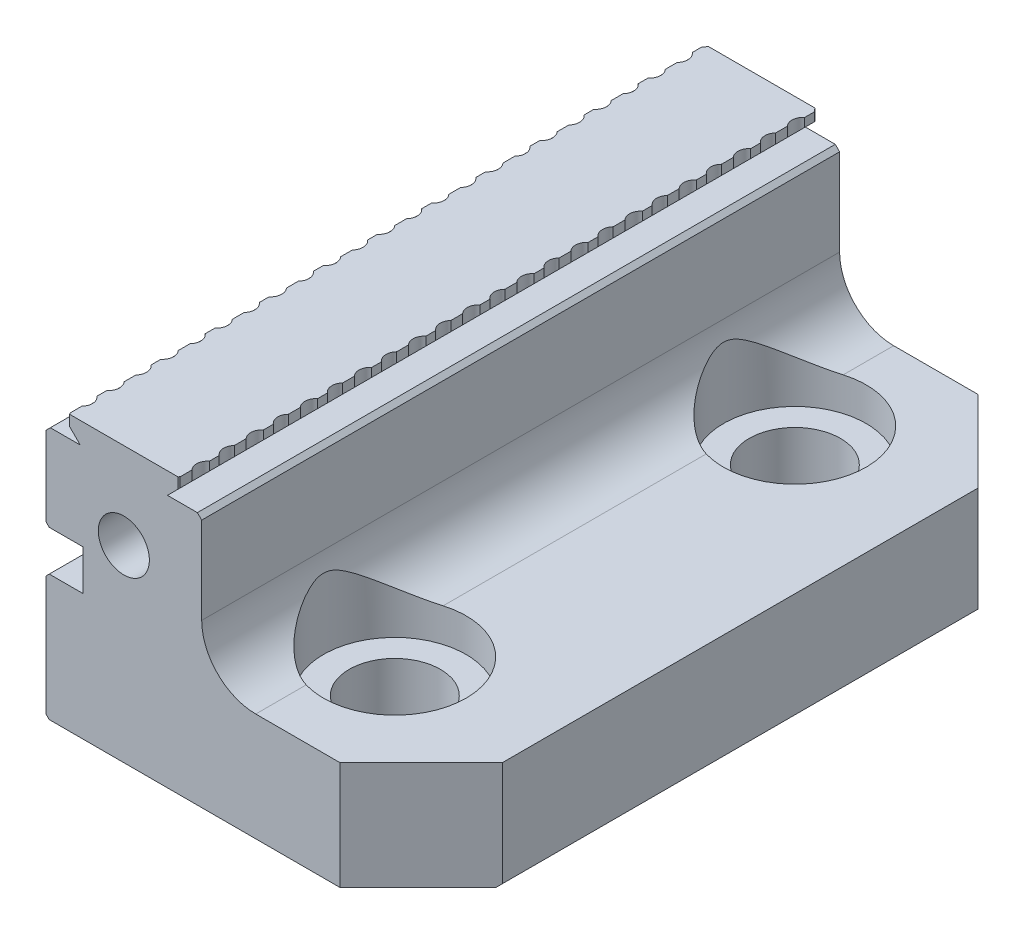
from build123d import *

# Parameters (mm, degrees)
BOSS_EXTRUDE1_DEPTH                           = 62.865
CUT_EXTRUDE1_JAW_TOOTH_REACH                  = 76.014
LPATTERN1_COUNT                               = 20
LPATTERN1_PITCH                               = 6.35762
CBORE_FOR_3_8_SOCKET_HEAD_CAP_SCREW1_AT_COUNT = 2
CBORE_FOR_3_8_SOCKET_HEAD_CAP_SCREW1_AT_PITCH = 46.99
F_97_0_0059_DIAMETER_HOLE5_D                  = 8.01624
F_97_0_0059_DIAMETER_HOLE5_DEPTH              = 6.858
F_97_0_0059_DIAMETER_HOLE5_CSINK_D            = 9.398
F_97_0_0059_DIAMETER_HOLE5_CSINK_ANGLE        = 90
CHAMFER1_SIZE                                 = 15.875
CHAMFER2_SIZE                                 = 0.254
SKETCH9_W                                     = 4.318
SKETCH9_H                                     = 4.7498
CUT_EXTRUDE1_STOP_GROOVE_DEPTH                = 129.661170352
STEP_CHAMFER_SIZE                             = 0.381
OUTSIDE_DOVETAIL_CHAMFER_SIZE                 = 0.508
INSIDE_DOVETAIL_CHAMFER_SIZE                  = 0.508
BOTTOM_OUTSIDE_EDGE_CHAMFER_SIZE              = 0.381
OUTSIDE_JAW_FACE_EDGE_CHAMFER_SIZE            = 0.381
SKETCH19_OUTSIDE_W                            = 73.484
SKETCH19_OUTSIDE_H                            = 155.146
SKETCH19_OUTSIDE_W_2                          = 44.069
SKETCH19_OUTSIDE_H_2                          = 74.93
CUT_EXTRUDE4_DEPTH                            = 75.014228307
CHAMFER3_SIZE                                 = 9.525


with BuildPart() as part:
    # Sketch1 → Boss-Extrude1 (new, symmetric)
    with BuildSketch(Plane.XY):
        with BuildLine():
            Line((-22.0345, -16.129), (22.0345, -16.129))
            Line((22.0345, -16.129), (22.0345, -3.429))
            Line((22.0345, -3.429), (2.6035, -3.429))
            ThreePointArc((2.6035, -3.429), (-1.886628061, -1.569128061), (-3.7465, 2.921))
            Line((-3.7465, 2.921), (-3.7465, 13.629))
            Line((-3.7465, 13.629), (-7.7705, 13.629))
            Line((-7.7705, 13.629), (-6.2865, 15.113))
            Line((-6.2865, 15.113), (-6.2865, 16.129))
            Line((-6.2865, 16.129), (-19.4945, 16.129))
            Line((-19.4945, 16.129), (-19.4945, 15.113))
            Line((-19.4945, 15.113), (-18.0105, 13.629))
            Line((-18.0105, 13.629), (-22.0345, 13.629))
            Line((-22.0345, 13.629), (-22.0345, -16.129))
        make_face()
    extrude(amount=BOSS_EXTRUDE1_DEPTH, both=True)

    # Sketch8 → Cut-Extrude1 JAW TOOTH (cut, up to next)
    with BuildSketch(Plane(origin=(0, 16.129, 0), x_dir=(1, 0, 0), z_dir=(0, 1, 0)), mode=Mode.PRIVATE) as cut_extrude1_jaw_tooth_sk1:
        with BuildLine():
            Line((-19.4945, 62.865), (-19.4945, 61.341))
            ThreePointArc((-19.4945, 61.341), (-19.015440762, 60.413590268), (-19.3675, 59.43092))
            Line((-19.3675, 59.43092), (-19.3675, 58.04408))
            ThreePointArc((-19.3675, 58.04408), (-19.015440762, 57.061409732), (-19.4945, 56.134))
            Line((-19.4945, 56.134), (-22.233870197, 56.134))
            Line((-22.233870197, 56.134), (-22.233870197, 62.865))
            Line((-22.233870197, 62.865), (-19.4945, 62.865))
        make_face()
    cut_extrude1_jaw_tooth_tool1 = extrude(cut_extrude1_jaw_tooth_sk1.sketch, amount=-CUT_EXTRUDE1_JAW_TOOTH_REACH, mode=Mode.PRIVATE) & part.part
    # Sketch8 → Cut-Extrude1 JAW TOOTH (cut, up to next)
    with BuildSketch(Plane(origin=(0, 16.129, 0), x_dir=(1, 0, 0), z_dir=(0, 1, 0)), mode=Mode.PRIVATE) as cut_extrude1_jaw_tooth_sk2:
        with BuildLine():
            Line((-3.547129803, 62.865), (-6.2865, 62.865))
            Line((-6.2865, 62.865), (-6.2865, 61.341))
            ThreePointArc((-6.2865, 61.341), (-6.765559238, 60.413590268), (-6.4135, 59.43092))
            Line((-6.4135, 59.43092), (-6.4135, 58.04408))
            ThreePointArc((-6.4135, 58.04408), (-6.765559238, 57.061409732), (-6.2865, 56.134))
            Line((-6.2865, 56.134), (-3.547129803, 56.134))
            Line((-3.547129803, 56.134), (-3.547129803, 62.865))
        make_face()
    cut_extrude1_jaw_tooth_tool2 = extrude(cut_extrude1_jaw_tooth_sk2.sketch, amount=-CUT_EXTRUDE1_JAW_TOOTH_REACH, mode=Mode.PRIVATE) & part.part
    cut_extrude1_jaw_tooth_1 = cut_extrude1_jaw_tooth_tool1.solids().sort_by_distance((-20.745914, 16.129, -59.441435))[0]
    add(cut_extrude1_jaw_tooth_1, mode=Mode.SUBTRACT)
    cut_extrude1_jaw_tooth_2 = cut_extrude1_jaw_tooth_tool2.solids().sort_by_distance((-5.035086, 16.129, -59.441435))[0]
    add(cut_extrude1_jaw_tooth_2, mode=Mode.SUBTRACT)
    cut_extrude1_jaw_tooth = cut_extrude1_jaw_tooth_1 + cut_extrude1_jaw_tooth_2  # Cut-Extrude1 JAW TOOTH as one shape, for the pattern or mirror that repeats it

    # LPattern1: Cut-Extrude1 JAW TOOTH ×20
    with Locations(*[(0, 0, i * LPATTERN1_PITCH) for i in range(1, LPATTERN1_COUNT)]):
        add(cut_extrude1_jaw_tooth, mode=Mode.SUBTRACT)

    # Sketch2 → CBORE for 3_8 Socket Head Cap Screw1 (revolve, cut)
    with BuildSketch(Plane(origin=(4.9657, 16.129, -23.495), x_dir=(0, 0, 1), z_dir=(1, 0, 0))):
        Polygon((0, 0), (0, 32.258), (5.969, 32.258), (5.3594, 31.6484), (5.3594, 23.495), (8.382, 23.495), (8.382, 0), align=None)
    cbore_for_3_8_socket_head_cap_screw1 = revolve(axis=Axis((4.9657, 22.479, -23.495), (0, -1, 0)), mode=Mode.SUBTRACT)

    # CBORE for 3_8 Socket Head Cap Screw1 at: CBORE for 3_8 Socket Head Cap Screw1 ×2
    with Locations(*[(0, 0, i * CBORE_FOR_3_8_SOCKET_HEAD_CAP_SCREW1_AT_PITCH) for i in range(1, CBORE_FOR_3_8_SOCKET_HEAD_CAP_SCREW1_AT_COUNT)]):
        add(cbore_for_3_8_socket_head_cap_screw1, mode=Mode.SUBTRACT)

    # 97 _0.0059_ Diameter Hole5
    with Locations(Plane.XZ.offset(16.129)):
        with Locations((16.656299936, 23.5), (-6.7437, -23.5)):
            CounterSinkHole(F_97_0_0059_DIAMETER_HOLE5_D / 2, F_97_0_0059_DIAMETER_HOLE5_CSINK_D / 2, depth=F_97_0_0059_DIAMETER_HOLE5_DEPTH, counter_sink_angle=F_97_0_0059_DIAMETER_HOLE5_CSINK_ANGLE)

    # Chamfer1
    chamfer1_edges = [part.edges().sort_by_distance(p)[0] for p in [
        (22.0345, -9.779, 62.865),
        (22.0345, -9.779, -62.865),
    ]]
    chamfer(chamfer1_edges, length=CHAMFER1_SIZE)

    # Chamfer2
    chamfer2_edges = [part.edges().sort_by_distance(p)[0] for p in [
        (-12.8905, 16.129, -62.865),
        (-12.8905, 16.129, 62.865),
    ]]
    chamfer(chamfer2_edges, length=CHAMFER2_SIZE)

    # Sketch9 → Cut-Extrude1 STOP GROOVE (cut, through all)
    with BuildSketch(Plane(origin=(0, 0, -62.865), x_dir=(-1, 0, 0), z_dir=(0, 0, -1))):
        with Locations((19.8755, 1.0541)):
            Rectangle(SKETCH9_W, SKETCH9_H)
    extrude(amount=-CUT_EXTRUDE1_STOP_GROOVE_DEPTH, mode=Mode.SUBTRACT)

    # STEP CHAMFER
    step_chamfer_edges = [part.edges().sort_by_distance(p)[0] for p in [
        (-22.0345, 3.429, 0),
        (-22.0345, -1.3208, 0),
    ]]
    chamfer(step_chamfer_edges, length=STEP_CHAMFER_SIZE)

    # OUTSIDE DOVETAIL CHAMFER
    outside_dovetail_chamfer_edges = [part.edges().sort_by_distance(p)[0] for p in [
        (-22.0345, 13.629, 0),
    ]]
    chamfer(outside_dovetail_chamfer_edges, length=OUTSIDE_DOVETAIL_CHAMFER_SIZE)

    # INSIDE DOVETAIL CHAMFER
    inside_dovetail_chamfer_edges = [part.edges().sort_by_distance(p)[0] for p in [
        (-3.7465, 13.629, 0),
    ]]
    chamfer(inside_dovetail_chamfer_edges, length=INSIDE_DOVETAIL_CHAMFER_SIZE)

    # BOTTOM OUTSIDE EDGE CHAMFER
    bottom_outside_edge_chamfer_edges = [part.edges().sort_by_distance(p)[0] for p in [
        (-7.9375, -16.129, -62.865),
        (-22.0345, -16.129, 0),
        (22.0345, -16.129, 0),
        (14.097, -16.129, 54.9275),
        (14.097, -16.129, -54.9275),
        (-7.9375, -16.129, 62.865),
    ]]
    chamfer(bottom_outside_edge_chamfer_edges, length=BOTTOM_OUTSIDE_EDGE_CHAMFER_SIZE)

    # OUTSIDE JAW FACE EDGE CHAMFER
    outside_jaw_face_edge_chamfer_edges = [part.edges().sort_by_distance(p)[0] for p in [
        (-22.0345, 8.4655, -62.865),
        (-22.0345, -8.7249, -62.865),
        (-22.0345, 8.4655, 62.865),
        (-22.0345, -8.7249, 62.865),
    ]]
    chamfer(outside_jaw_face_edge_chamfer_edges, length=OUTSIDE_JAW_FACE_EDGE_CHAMFER_SIZE)

    # Sketch19 outside → Cut-Extrude4 (cut, through all)
    with BuildSketch(Plane(origin=(0, 16.129, 0), x_dir=(1, 0, 0), z_dir=(0, 1, 0))):
        Rectangle(SKETCH19_OUTSIDE_W, SKETCH19_OUTSIDE_H)
        Rectangle(SKETCH19_OUTSIDE_W_2, SKETCH19_OUTSIDE_H_2, mode=Mode.SUBTRACT)
    extrude(amount=-CUT_EXTRUDE4_DEPTH, mode=Mode.SUBTRACT)

    # Chamfer3
    chamfer3_edges = [part.edges().sort_by_distance(p)[0] for p in [
        (22.0345, -9.5885, 37.465),
        (22.0345, -9.5885, -37.465),
    ]]
    chamfer(chamfer3_edges, length=CHAMFER3_SIZE)

    # Sketch20 → M6x1.0 Tapped Hole1 (revolve, cut)
    with BuildSketch(Plane(origin=(-12.8905, 5.969, 37.465), x_dir=(0, -1, 0), z_dir=(1, 0, 0))):
        Polygon((0, 0), (0, 13.440151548), (2.5, 11.938), (2.5, 11.9888), (3, 11.9888), (3, 0), align=None)
    m6x1_0_tapped_hole1 = revolve(axis=Axis((-12.8905, 5.969, 43.815), (0, 0, -1)), mode=Mode.SUBTRACT)

    # Mirror2: M6x1.0 Tapped Hole1 across plane
    add(m6x1_0_tapped_hole1.mirror(Plane.XY), mode=Mode.SUBTRACT)


solid = part.part
